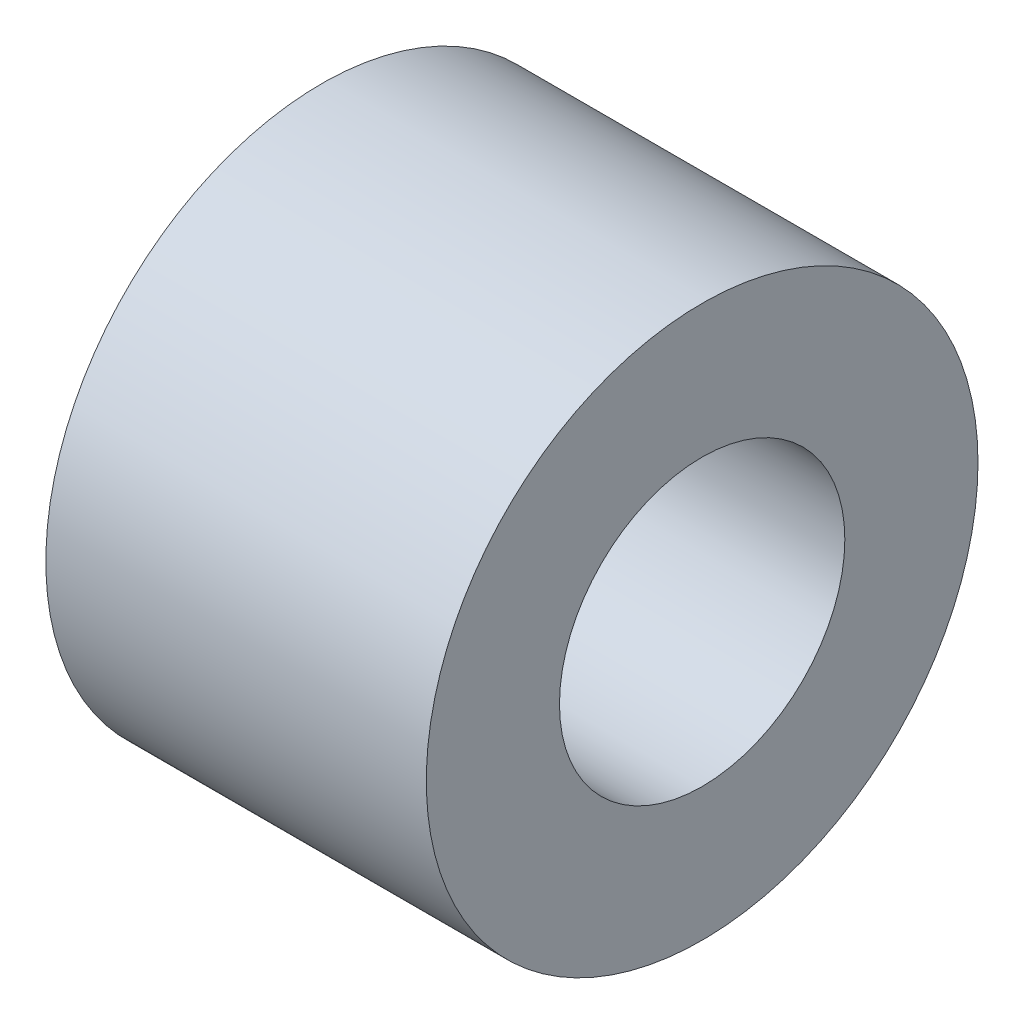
from build123d import *

# Parameters (mm, degrees)
ESQUISSE1_R      = 2.9
ESQUISSE1_R_2    = 1.5
EXTRUSION1_DEPTH = 4


with BuildPart() as part:
    # Esquisse1 → Extrusion1 (new body)
    with BuildSketch(Plane(origin=(0, 0, 0), x_dir=(0, 0, -1), z_dir=(1, 0, 0))):
        Circle(ESQUISSE1_R)
        Circle(ESQUISSE1_R_2, mode=Mode.SUBTRACT)
    extrude(amount=EXTRUSION1_DEPTH)


solid = part.part
